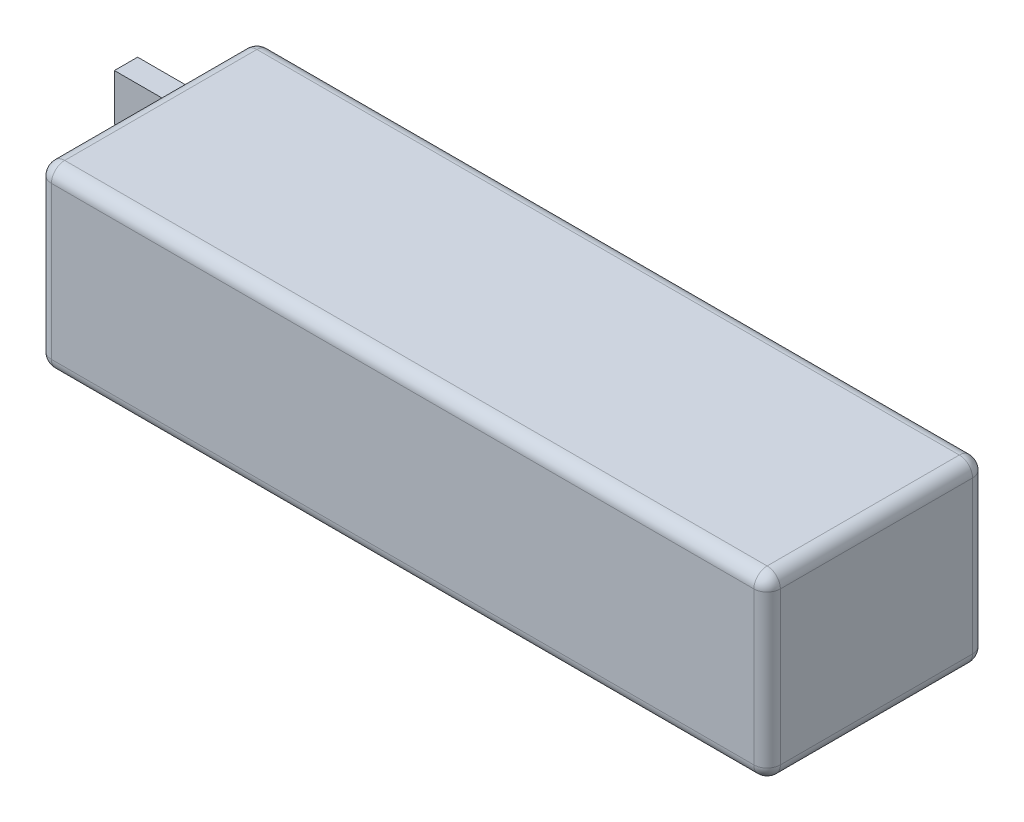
ISO-10303-21;
HEADER;
FILE_DESCRIPTION(('STEP AP214'),'2;1');
FILE_NAME('part.step','',(''),(''),'','','');
FILE_SCHEMA(('AUTOMOTIVE_DESIGN { 1 0 10303 214 1 1 1 1 }'));
ENDSEC;
DATA;
#1=APPLICATION_CONTEXT('core data for automotive mechanical design processes');
#2=APPLICATION_PROTOCOL_DEFINITION('international standard','automotive_design',2000,#1);
#3=PRODUCT_CONTEXT('',#1,'mechanical');
#4=PRODUCT('Part','Part','',(#3));
#5=PRODUCT_RELATED_PRODUCT_CATEGORY('part','',(#4));
#6=PRODUCT_DEFINITION_FORMATION('','',#4);
#7=PRODUCT_DEFINITION_CONTEXT('part definition',#1,'design');
#8=PRODUCT_DEFINITION('design','',#6,#7);
#9=PRODUCT_DEFINITION_SHAPE('','',#8);
#10=(LENGTH_UNIT() NAMED_UNIT(*) SI_UNIT(.MILLI.,.METRE.));
#11=(NAMED_UNIT(*) PLANE_ANGLE_UNIT() SI_UNIT($,.RADIAN.));
#12=(NAMED_UNIT(*) SI_UNIT($,.STERADIAN.) SOLID_ANGLE_UNIT());
#13=UNCERTAINTY_MEASURE_WITH_UNIT(LENGTH_MEASURE(1.E-05),#10,'distance_accuracy_value','');
#14=(GEOMETRIC_REPRESENTATION_CONTEXT(3) GLOBAL_UNCERTAINTY_ASSIGNED_CONTEXT((#13)) GLOBAL_UNIT_ASSIGNED_CONTEXT((#10,
#11,#12)) REPRESENTATION_CONTEXT('',''));
#15=CARTESIAN_POINT('',(0.,0.,0.));
#16=DIRECTION('',(0.,0.,1.));
#17=DIRECTION('',(1.,0.,0.));
#18=AXIS2_PLACEMENT_3D('',#15,#16,#17);
#19=CARTESIAN_POINT('',(0.,27.,0.));
#20=DIRECTION('',(1.,0.,0.));
#21=DIRECTION('',(0.,0.,-1.));
#22=AXIS2_PLACEMENT_3D('',#19,#20,#21);
#23=PLANE('',#22);
#24=DIRECTION('',(0.,0.,-1.));
#25=VECTOR('',#24,1.);
#26=CARTESIAN_POINT('',(0.,17.,-31.));
#27=LINE('',#26,#25);
#28=CARTESIAN_POINT('',(0.,17.,-27.5));
#29=VERTEX_POINT('',#28);
#30=CARTESIAN_POINT('',(0.,17.,-31.));
#31=VERTEX_POINT('',#30);
#32=EDGE_CURVE('E59',#29,#31,#27,.T.);
#33=ORIENTED_EDGE('',*,*,#32,.F.);
#34=DIRECTION('',(0.,1.,0.));
#35=VECTOR('',#34,1.);
#36=CARTESIAN_POINT('',(0.,17.,-27.5));
#37=LINE('',#36,#35);
#38=CARTESIAN_POINT('',(0.,10.,-27.5));
#39=VERTEX_POINT('',#38);
#40=EDGE_CURVE('E63',#39,#29,#37,.T.);
#41=ORIENTED_EDGE('',*,*,#40,.F.);
#42=DIRECTION('',(0.,0.,1.));
#43=VECTOR('',#42,1.);
#44=CARTESIAN_POINT('',(0.,10.,-27.5));
#45=LINE('',#44,#43);
#46=CARTESIAN_POINT('',(0.,10.,-31.));
#47=VERTEX_POINT('',#46);
#48=EDGE_CURVE('E476',#47,#39,#45,.T.);
#49=ORIENTED_EDGE('',*,*,#48,.F.);
#50=DIRECTION('',(0.,-1.,0.));
#51=VECTOR('',#50,1.);
#52=CARTESIAN_POINT('',(0.,27.,-31.));
#53=LINE('',#52,#51);
#54=CARTESIAN_POINT('',(0.,2.,-31.));
#55=VERTEX_POINT('',#54);
#56=EDGE_CURVE('E199',#47,#55,#53,.T.);
#57=ORIENTED_EDGE('',*,*,#56,.T.);
#58=DIRECTION('',(0.,0.,1.));
#59=VECTOR('',#58,1.);
#60=CARTESIAN_POINT('',(0.,2.,0.));
#61=LINE('',#60,#59);
#62=CARTESIAN_POINT('',(0.,2.,-2.));
#63=VERTEX_POINT('',#62);
#64=EDGE_CURVE('E193',#55,#63,#61,.T.);
#65=ORIENTED_EDGE('',*,*,#64,.T.);
#66=DIRECTION('',(0.,-1.,0.));
#67=VECTOR('',#66,1.);
#68=CARTESIAN_POINT('',(0.,27.,-2.));
#69=LINE('',#68,#67);
#70=CARTESIAN_POINT('',(0.,25.,-2.));
#71=VERTEX_POINT('',#70);
#72=EDGE_CURVE('E196',#63,#71,#69,.F.);
#73=ORIENTED_EDGE('',*,*,#72,.T.);
#74=DIRECTION('',(0.,0.,1.));
#75=VECTOR('',#74,1.);
#76=CARTESIAN_POINT('',(0.,25.,0.));
#77=LINE('',#76,#75);
#78=CARTESIAN_POINT('',(0.,25.,-31.));
#79=VERTEX_POINT('',#78);
#80=EDGE_CURVE('E203',#71,#79,#77,.F.);
#81=ORIENTED_EDGE('',*,*,#80,.T.);
#82=EDGE_CURVE('E200',#79,#31,#53,.T.);
#83=ORIENTED_EDGE('',*,*,#82,.T.);
#84=EDGE_LOOP('',(#33,#41,#49,#57,#65,#73,#81,#83));
#85=FACE_BOUND('',#84,.T.);
#86=ADVANCED_FACE('F41',(#85),#23,.F.);
#87=CARTESIAN_POINT('',(0.,27.,0.));
#88=DIRECTION('',(0.,0.,-1.));
#89=DIRECTION('',(-1.,0.,0.));
#90=AXIS2_PLACEMENT_3D('',#87,#88,#89);
#91=PLANE('',#90);
#92=DIRECTION('',(0.,-1.,0.));
#93=VECTOR('',#92,1.);
#94=CARTESIAN_POINT('',(108.,27.,0.));
#95=LINE('',#94,#93);
#96=CARTESIAN_POINT('',(108.,2.,0.));
#97=VERTEX_POINT('',#96);
#98=CARTESIAN_POINT('',(108.,25.,0.));
#99=VERTEX_POINT('',#98);
#100=EDGE_CURVE('E235',#97,#99,#95,.F.);
#101=ORIENTED_EDGE('',*,*,#100,.T.);
#102=DIRECTION('',(1.,0.,0.));
#103=VECTOR('',#102,1.);
#104=CARTESIAN_POINT('',(0.,25.,0.));
#105=LINE('',#104,#103);
#106=CARTESIAN_POINT('',(2.,25.,0.));
#107=VERTEX_POINT('',#106);
#108=EDGE_CURVE('E242',#99,#107,#105,.F.);
#109=ORIENTED_EDGE('',*,*,#108,.T.);
#110=DIRECTION('',(0.,-1.,0.));
#111=VECTOR('',#110,1.);
#112=CARTESIAN_POINT('',(2.,27.,0.));
#113=LINE('',#112,#111);
#114=CARTESIAN_POINT('',(2.,2.,0.));
#115=VERTEX_POINT('',#114);
#116=EDGE_CURVE('E238',#107,#115,#113,.T.);
#117=ORIENTED_EDGE('',*,*,#116,.T.);
#118=DIRECTION('',(1.,0.,0.));
#119=VECTOR('',#118,1.);
#120=CARTESIAN_POINT('',(110.,2.,0.));
#121=LINE('',#120,#119);
#122=EDGE_CURVE('E232',#115,#97,#121,.T.);
#123=ORIENTED_EDGE('',*,*,#122,.T.);
#124=EDGE_LOOP('',(#101,#109,#117,#123));
#125=FACE_BOUND('',#124,.T.);
#126=ADVANCED_FACE('F378',(#125),#91,.F.);
#127=CARTESIAN_POINT('',(110.,27.,0.));
#128=DIRECTION('',(-1.,0.,0.));
#129=DIRECTION('',(0.,0.,1.));
#130=AXIS2_PLACEMENT_3D('',#127,#128,#129);
#131=PLANE('',#130);
#132=DIRECTION('',(0.,-1.,0.));
#133=VECTOR('',#132,1.);
#134=CARTESIAN_POINT('',(110.,27.,-31.));
#135=LINE('',#134,#133);
#136=CARTESIAN_POINT('',(110.,2.,-31.));
#137=VERTEX_POINT('',#136);
#138=CARTESIAN_POINT('',(110.,25.,-31.));
#139=VERTEX_POINT('',#138);
#140=EDGE_CURVE('E225',#137,#139,#135,.F.);
#141=ORIENTED_EDGE('',*,*,#140,.T.);
#142=DIRECTION('',(0.,0.,-1.));
#143=VECTOR('',#142,1.);
#144=CARTESIAN_POINT('',(110.,25.,0.));
#145=LINE('',#144,#143);
#146=CARTESIAN_POINT('',(110.,25.,-2.));
#147=VERTEX_POINT('',#146);
#148=EDGE_CURVE('E229',#139,#147,#145,.F.);
#149=ORIENTED_EDGE('',*,*,#148,.T.);
#150=DIRECTION('',(0.,-1.,0.));
#151=VECTOR('',#150,1.);
#152=CARTESIAN_POINT('',(110.,27.,-2.));
#153=LINE('',#152,#151);
#154=CARTESIAN_POINT('',(110.,2.,-2.));
#155=VERTEX_POINT('',#154);
#156=EDGE_CURVE('E222',#147,#155,#153,.T.);
#157=ORIENTED_EDGE('',*,*,#156,.T.);
#158=DIRECTION('',(0.,0.,-1.));
#159=VECTOR('',#158,1.);
#160=CARTESIAN_POINT('',(110.,2.,-33.));
#161=LINE('',#160,#159);
#162=EDGE_CURVE('E219',#155,#137,#161,.T.);
#163=ORIENTED_EDGE('',*,*,#162,.T.);
#164=EDGE_LOOP('',(#141,#149,#157,#163));
#165=FACE_BOUND('',#164,.T.);
#166=ADVANCED_FACE('F400',(#165),#131,.F.);
#167=CARTESIAN_POINT('',(0.,27.,-33.));
#168=DIRECTION('',(0.,0.,1.));
#169=DIRECTION('',(1.,0.,0.));
#170=AXIS2_PLACEMENT_3D('',#167,#168,#169);
#171=PLANE('',#170);
#172=DIRECTION('',(0.,-1.,0.));
#173=VECTOR('',#172,1.);
#174=CARTESIAN_POINT('',(2.,27.,-33.));
#175=LINE('',#174,#173);
#176=CARTESIAN_POINT('',(2.,2.,-33.));
#177=VERTEX_POINT('',#176);
#178=CARTESIAN_POINT('',(2.,25.,-33.));
#179=VERTEX_POINT('',#178);
#180=EDGE_CURVE('E212',#177,#179,#175,.F.);
#181=ORIENTED_EDGE('',*,*,#180,.T.);
#182=DIRECTION('',(-1.,0.,0.));
#183=VECTOR('',#182,1.);
#184=CARTESIAN_POINT('',(0.,25.,-33.));
#185=LINE('',#184,#183);
#186=CARTESIAN_POINT('',(108.,25.,-33.));
#187=VERTEX_POINT('',#186);
#188=EDGE_CURVE('E216',#179,#187,#185,.F.);
#189=ORIENTED_EDGE('',*,*,#188,.T.);
#190=DIRECTION('',(0.,-1.,0.));
#191=VECTOR('',#190,1.);
#192=CARTESIAN_POINT('',(108.,27.,-33.));
#193=LINE('',#192,#191);
#194=CARTESIAN_POINT('',(108.,2.,-33.));
#195=VERTEX_POINT('',#194);
#196=EDGE_CURVE('E209',#187,#195,#193,.T.);
#197=ORIENTED_EDGE('',*,*,#196,.T.);
#198=DIRECTION('',(-1.,0.,0.));
#199=VECTOR('',#198,1.);
#200=CARTESIAN_POINT('',(0.,2.,-33.));
#201=LINE('',#200,#199);
#202=EDGE_CURVE('E206',#195,#177,#201,.T.);
#203=ORIENTED_EDGE('',*,*,#202,.T.);
#204=EDGE_LOOP('',(#181,#189,#197,#203));
#205=FACE_BOUND('',#204,.T.);
#206=ADVANCED_FACE('F471',(#205),#171,.F.);
#207=CARTESIAN_POINT('',(0.,27.,0.));
#208=DIRECTION('',(0.,-1.,0.));
#209=DIRECTION('',(0.,0.,-1.));
#210=AXIS2_PLACEMENT_3D('',#207,#208,#209);
#211=PLANE('',#210);
#212=DIRECTION('',(0.,0.,-1.));
#213=VECTOR('',#212,1.);
#214=CARTESIAN_POINT('',(108.,27.,0.));
#215=LINE('',#214,#213);
#216=CARTESIAN_POINT('',(108.,27.,-2.));
#217=VERTEX_POINT('',#216);
#218=CARTESIAN_POINT('',(108.,27.,-31.));
#219=VERTEX_POINT('',#218);
#220=EDGE_CURVE('E251',#217,#219,#215,.T.);
#221=ORIENTED_EDGE('',*,*,#220,.T.);
#222=DIRECTION('',(-1.,0.,0.));
#223=VECTOR('',#222,1.);
#224=CARTESIAN_POINT('',(0.,27.,-31.));
#225=LINE('',#224,#223);
#226=CARTESIAN_POINT('',(2.,27.,-31.));
#227=VERTEX_POINT('',#226);
#228=EDGE_CURVE('E254',#219,#227,#225,.T.);
#229=ORIENTED_EDGE('',*,*,#228,.T.);
#230=DIRECTION('',(0.,0.,1.));
#231=VECTOR('',#230,1.);
#232=CARTESIAN_POINT('',(2.,27.,0.));
#233=LINE('',#232,#231);
#234=CARTESIAN_POINT('',(2.,27.,-2.));
#235=VERTEX_POINT('',#234);
#236=EDGE_CURVE('E245',#227,#235,#233,.T.);
#237=ORIENTED_EDGE('',*,*,#236,.T.);
#238=DIRECTION('',(1.,0.,0.));
#239=VECTOR('',#238,1.);
#240=CARTESIAN_POINT('',(0.,27.,-2.));
#241=LINE('',#240,#239);
#242=EDGE_CURVE('E248',#235,#217,#241,.T.);
#243=ORIENTED_EDGE('',*,*,#242,.T.);
#244=EDGE_LOOP('',(#221,#229,#237,#243));
#245=FACE_BOUND('',#244,.T.);
#246=ADVANCED_FACE('F369',(#245),#211,.F.);
#247=CARTESIAN_POINT('',(0.,0.,0.));
#248=DIRECTION('',(0.,-1.,0.));
#249=DIRECTION('',(0.,0.,-1.));
#250=AXIS2_PLACEMENT_3D('',#247,#248,#249);
#251=PLANE('',#250);
#252=DIRECTION('',(0.,0.,-1.));
#253=VECTOR('',#252,1.);
#254=CARTESIAN_POINT('',(108.,0.,0.));
#255=LINE('',#254,#253);
#256=CARTESIAN_POINT('',(108.,0.,-31.));
#257=VERTEX_POINT('',#256);
#258=CARTESIAN_POINT('',(108.,0.,-2.));
#259=VERTEX_POINT('',#258);
#260=EDGE_CURVE('E51',#257,#259,#255,.F.);
#261=ORIENTED_EDGE('',*,*,#260,.T.);
#262=DIRECTION('',(1.,0.,0.));
#263=VECTOR('',#262,1.);
#264=CARTESIAN_POINT('',(0.,0.,-2.));
#265=LINE('',#264,#263);
#266=CARTESIAN_POINT('',(2.,0.,-2.));
#267=VERTEX_POINT('',#266);
#268=EDGE_CURVE('E11',#259,#267,#265,.F.);
#269=ORIENTED_EDGE('',*,*,#268,.T.);
#270=DIRECTION('',(0.,0.,1.));
#271=VECTOR('',#270,1.);
#272=CARTESIAN_POINT('',(2.,0.,-33.));
#273=LINE('',#272,#271);
#274=CARTESIAN_POINT('',(2.,0.,-31.));
#275=VERTEX_POINT('',#274);
#276=EDGE_CURVE('E258',#267,#275,#273,.F.);
#277=ORIENTED_EDGE('',*,*,#276,.T.);
#278=DIRECTION('',(-1.,0.,0.));
#279=VECTOR('',#278,1.);
#280=CARTESIAN_POINT('',(110.,0.,-31.));
#281=LINE('',#280,#279);
#282=EDGE_CURVE('E261',#275,#257,#281,.F.);
#283=ORIENTED_EDGE('',*,*,#282,.T.);
#284=EDGE_LOOP('',(#261,#269,#277,#283));
#285=FACE_BOUND('',#284,.T.);
#286=ADVANCED_FACE('F515',(#285),#251,.T.);
#287=CARTESIAN_POINT('',(108.,27.,-2.));
#288=DIRECTION('',(0.,-1.,0.));
#289=DIRECTION('',(0.,0.,-1.));
#290=AXIS2_PLACEMENT_3D('',#287,#288,#289);
#291=CYLINDRICAL_SURFACE('',#290,2.);
#292=CARTESIAN_POINT('',(108.,25.,-2.));
#293=DIRECTION('',(0.,1.,0.));
#294=DIRECTION('',(0.,0.,1.));
#295=AXIS2_PLACEMENT_3D('',#292,#293,#294);
#296=CIRCLE('',#295,2.);
#297=EDGE_CURVE('E45',#99,#147,#296,.T.);
#298=ORIENTED_EDGE('',*,*,#297,.F.);
#299=ORIENTED_EDGE('',*,*,#100,.F.);
#300=CARTESIAN_POINT('',(108.,2.,-2.));
#301=DIRECTION('',(0.,-1.,0.));
#302=DIRECTION('',(0.,0.,-1.));
#303=AXIS2_PLACEMENT_3D('',#300,#301,#302);
#304=CIRCLE('',#303,2.);
#305=EDGE_CURVE('E344',#155,#97,#304,.T.);
#306=ORIENTED_EDGE('',*,*,#305,.F.);
#307=ORIENTED_EDGE('',*,*,#156,.F.);
#308=EDGE_LOOP('',(#298,#299,#306,#307));
#309=FACE_BOUND('',#308,.T.);
#310=ADVANCED_FACE('F43',(#309),#291,.T.);
#311=CARTESIAN_POINT('',(108.,25.,-2.));
#312=DIRECTION('',(0.,0.,1.));
#313=DIRECTION('',(1.,0.,0.));
#314=AXIS2_PLACEMENT_3D('',#311,#312,#313);
#315=SPHERICAL_SURFACE('',#314,2.);
#316=CARTESIAN_POINT('',(108.,25.,-2.));
#317=DIRECTION('',(1.,0.,0.));
#318=DIRECTION('',(0.,0.,-1.));
#319=AXIS2_PLACEMENT_3D('',#316,#317,#318);
#320=CIRCLE('',#319,2.);
#321=EDGE_CURVE('E337',#99,#217,#320,.F.);
#322=ORIENTED_EDGE('',*,*,#321,.F.);
#323=ORIENTED_EDGE('',*,*,#297,.T.);
#324=CARTESIAN_POINT('',(108.,25.,-2.));
#325=DIRECTION('',(0.,0.,1.));
#326=DIRECTION('',(1.,0.,0.));
#327=AXIS2_PLACEMENT_3D('',#324,#325,#326);
#328=CIRCLE('',#327,2.);
#329=EDGE_CURVE('E341',#217,#147,#328,.F.);
#330=ORIENTED_EDGE('',*,*,#329,.F.);
#331=EDGE_LOOP('',(#322,#323,#330));
#332=FACE_BOUND('',#331,.T.);
#333=ADVANCED_FACE('F357',(#332),#315,.T.);
#334=CARTESIAN_POINT('',(108.,2.,-2.));
#335=DIRECTION('',(0.,0.,1.));
#336=DIRECTION('',(1.,0.,0.));
#337=AXIS2_PLACEMENT_3D('',#334,#335,#336);
#338=SPHERICAL_SURFACE('',#337,2.);
#339=CARTESIAN_POINT('',(108.,2.,-2.));
#340=DIRECTION('',(0.,0.,1.));
#341=DIRECTION('',(1.,0.,0.));
#342=AXIS2_PLACEMENT_3D('',#339,#340,#341);
#343=CIRCLE('',#342,2.);
#344=EDGE_CURVE('E329',#155,#259,#343,.F.);
#345=ORIENTED_EDGE('',*,*,#344,.F.);
#346=ORIENTED_EDGE('',*,*,#305,.T.);
#347=CARTESIAN_POINT('',(108.,2.,-2.));
#348=DIRECTION('',(1.,0.,0.));
#349=DIRECTION('',(0.,0.,-1.));
#350=AXIS2_PLACEMENT_3D('',#347,#348,#349);
#351=CIRCLE('',#350,2.);
#352=EDGE_CURVE('E333',#259,#97,#351,.F.);
#353=ORIENTED_EDGE('',*,*,#352,.F.);
#354=EDGE_LOOP('',(#345,#346,#353));
#355=FACE_BOUND('',#354,.T.);
#356=ADVANCED_FACE('F393',(#355),#338,.T.);
#357=CARTESIAN_POINT('',(108.,25.,0.));
#358=DIRECTION('',(0.,0.,-1.));
#359=DIRECTION('',(-1.,0.,0.));
#360=AXIS2_PLACEMENT_3D('',#357,#358,#359);
#361=CYLINDRICAL_SURFACE('',#360,2.);
#362=ORIENTED_EDGE('',*,*,#329,.T.);
#363=ORIENTED_EDGE('',*,*,#148,.F.);
#364=CARTESIAN_POINT('',(108.,25.,-31.));
#365=DIRECTION('',(0.,0.,-1.));
#366=DIRECTION('',(-1.,0.,0.));
#367=AXIS2_PLACEMENT_3D('',#364,#365,#366);
#368=CIRCLE('',#367,2.);
#369=EDGE_CURVE('E322',#219,#139,#368,.T.);
#370=ORIENTED_EDGE('',*,*,#369,.F.);
#371=ORIENTED_EDGE('',*,*,#220,.F.);
#372=EDGE_LOOP('',(#362,#363,#370,#371));
#373=FACE_BOUND('',#372,.T.);
#374=ADVANCED_FACE('F365',(#373),#361,.T.);
#375=CARTESIAN_POINT('',(0.,25.,-2.));
#376=DIRECTION('',(1.,0.,0.));
#377=DIRECTION('',(0.,0.,-1.));
#378=AXIS2_PLACEMENT_3D('',#375,#376,#377);
#379=CYLINDRICAL_SURFACE('',#378,2.);
#380=ORIENTED_EDGE('',*,*,#321,.T.);
#381=ORIENTED_EDGE('',*,*,#242,.F.);
#382=CARTESIAN_POINT('',(2.,25.,-2.));
#383=DIRECTION('',(-1.,0.,0.));
#384=DIRECTION('',(0.,0.,1.));
#385=AXIS2_PLACEMENT_3D('',#382,#383,#384);
#386=CIRCLE('',#385,2.);
#387=EDGE_CURVE('E318',#107,#235,#386,.T.);
#388=ORIENTED_EDGE('',*,*,#387,.F.);
#389=ORIENTED_EDGE('',*,*,#108,.F.);
#390=EDGE_LOOP('',(#380,#381,#388,#389));
#391=FACE_BOUND('',#390,.T.);
#392=ADVANCED_FACE('F375',(#391),#379,.T.);
#393=CARTESIAN_POINT('',(2.,27.,-2.));
#394=DIRECTION('',(0.,-1.,0.));
#395=DIRECTION('',(0.,0.,-1.));
#396=AXIS2_PLACEMENT_3D('',#393,#394,#395);
#397=CYLINDRICAL_SURFACE('',#396,2.);
#398=CARTESIAN_POINT('',(2.,2.,-2.));
#399=DIRECTION('',(0.,-1.,0.));
#400=DIRECTION('',(0.,0.,-1.));
#401=AXIS2_PLACEMENT_3D('',#398,#399,#400);
#402=CIRCLE('',#401,2.);
#403=EDGE_CURVE('E310',#115,#63,#402,.T.);
#404=ORIENTED_EDGE('',*,*,#403,.F.);
#405=ORIENTED_EDGE('',*,*,#116,.F.);
#406=CARTESIAN_POINT('',(2.,25.,-2.));
#407=DIRECTION('',(0.,1.,0.));
#408=DIRECTION('',(0.,0.,1.));
#409=AXIS2_PLACEMENT_3D('',#406,#407,#408);
#410=CIRCLE('',#409,2.);
#411=EDGE_CURVE('E314',#71,#107,#410,.T.);
#412=ORIENTED_EDGE('',*,*,#411,.F.);
#413=ORIENTED_EDGE('',*,*,#72,.F.);
#414=EDGE_LOOP('',(#404,#405,#412,#413));
#415=FACE_BOUND('',#414,.T.);
#416=ADVANCED_FACE('F382',(#415),#397,.T.);
#417=CARTESIAN_POINT('',(0.,2.,-2.));
#418=DIRECTION('',(-1.,0.,0.));
#419=DIRECTION('',(0.,0.,1.));
#420=AXIS2_PLACEMENT_3D('',#417,#418,#419);
#421=CYLINDRICAL_SURFACE('',#420,2.);
#422=ORIENTED_EDGE('',*,*,#352,.T.);
#423=ORIENTED_EDGE('',*,*,#122,.F.);
#424=CARTESIAN_POINT('',(2.,2.,-2.));
#425=DIRECTION('',(-1.,0.,0.));
#426=DIRECTION('',(0.,0.,1.));
#427=AXIS2_PLACEMENT_3D('',#424,#425,#426);
#428=CIRCLE('',#427,2.);
#429=EDGE_CURVE('E307',#267,#115,#428,.T.);
#430=ORIENTED_EDGE('',*,*,#429,.F.);
#431=ORIENTED_EDGE('',*,*,#268,.F.);
#432=EDGE_LOOP('',(#422,#423,#430,#431));
#433=FACE_BOUND('',#432,.T.);
#434=ADVANCED_FACE('F390',(#433),#421,.T.);
#435=CARTESIAN_POINT('',(108.,2.,0.));
#436=DIRECTION('',(0.,0.,1.));
#437=DIRECTION('',(1.,0.,0.));
#438=AXIS2_PLACEMENT_3D('',#435,#436,#437);
#439=CYLINDRICAL_SURFACE('',#438,2.);
#440=ORIENTED_EDGE('',*,*,#344,.T.);
#441=ORIENTED_EDGE('',*,*,#260,.F.);
#442=CARTESIAN_POINT('',(108.,2.,-31.));
#443=DIRECTION('',(0.,0.,-1.));
#444=DIRECTION('',(-1.,0.,0.));
#445=AXIS2_PLACEMENT_3D('',#442,#443,#444);
#446=CIRCLE('',#445,2.);
#447=EDGE_CURVE('E303',#137,#257,#446,.T.);
#448=ORIENTED_EDGE('',*,*,#447,.F.);
#449=ORIENTED_EDGE('',*,*,#162,.F.);
#450=EDGE_LOOP('',(#440,#441,#448,#449));
#451=FACE_BOUND('',#450,.T.);
#452=ADVANCED_FACE('F397',(#451),#439,.T.);
#453=CARTESIAN_POINT('',(108.,27.,-31.));
#454=DIRECTION('',(0.,-1.,0.));
#455=DIRECTION('',(0.,0.,-1.));
#456=AXIS2_PLACEMENT_3D('',#453,#454,#455);
#457=CYLINDRICAL_SURFACE('',#456,2.);
#458=CARTESIAN_POINT('',(108.,25.,-31.));
#459=DIRECTION('',(0.,1.,0.));
#460=DIRECTION('',(0.,0.,1.));
#461=AXIS2_PLACEMENT_3D('',#458,#459,#460);
#462=CIRCLE('',#461,2.);
#463=EDGE_CURVE('E325',#139,#187,#462,.T.);
#464=ORIENTED_EDGE('',*,*,#463,.F.);
#465=ORIENTED_EDGE('',*,*,#140,.F.);
#466=CARTESIAN_POINT('',(108.,2.,-31.));
#467=DIRECTION('',(0.,-1.,0.));
#468=DIRECTION('',(0.,0.,-1.));
#469=AXIS2_PLACEMENT_3D('',#466,#467,#468);
#470=CIRCLE('',#469,2.);
#471=EDGE_CURVE('E299',#195,#137,#470,.T.);
#472=ORIENTED_EDGE('',*,*,#471,.F.);
#473=ORIENTED_EDGE('',*,*,#196,.F.);
#474=EDGE_LOOP('',(#464,#465,#472,#473));
#475=FACE_BOUND('',#474,.T.);
#476=ADVANCED_FACE('F404',(#475),#457,.T.);
#477=CARTESIAN_POINT('',(108.,25.,-31.));
#478=DIRECTION('',(0.,0.,1.));
#479=DIRECTION('',(1.,0.,0.));
#480=AXIS2_PLACEMENT_3D('',#477,#478,#479);
#481=SPHERICAL_SURFACE('',#480,2.);
#482=ORIENTED_EDGE('',*,*,#369,.T.);
#483=ORIENTED_EDGE('',*,*,#463,.T.);
#484=CARTESIAN_POINT('',(108.,25.,-31.));
#485=DIRECTION('',(1.,0.,0.));
#486=DIRECTION('',(0.,0.,-1.));
#487=AXIS2_PLACEMENT_3D('',#484,#485,#486);
#488=CIRCLE('',#487,2.);
#489=EDGE_CURVE('E295',#219,#187,#488,.F.);
#490=ORIENTED_EDGE('',*,*,#489,.F.);
#491=EDGE_LOOP('',(#482,#483,#490));
#492=FACE_BOUND('',#491,.T.);
#493=ADVANCED_FACE('F408',(#492),#481,.T.);
#494=CARTESIAN_POINT('',(2.,25.,-2.));
#495=DIRECTION('',(0.,0.,1.));
#496=DIRECTION('',(1.,0.,0.));
#497=AXIS2_PLACEMENT_3D('',#494,#495,#496);
#498=SPHERICAL_SURFACE('',#497,2.);
#499=ORIENTED_EDGE('',*,*,#411,.T.);
#500=ORIENTED_EDGE('',*,*,#387,.T.);
#501=CARTESIAN_POINT('',(2.,25.,-2.));
#502=DIRECTION('',(0.,0.,1.));
#503=DIRECTION('',(1.,0.,0.));
#504=AXIS2_PLACEMENT_3D('',#501,#502,#503);
#505=CIRCLE('',#504,2.);
#506=EDGE_CURVE('E291',#71,#235,#505,.F.);
#507=ORIENTED_EDGE('',*,*,#506,.F.);
#508=EDGE_LOOP('',(#499,#500,#507));
#509=FACE_BOUND('',#508,.T.);
#510=ADVANCED_FACE('F420',(#509),#498,.T.);
#511=CARTESIAN_POINT('',(2.,2.,-2.));
#512=DIRECTION('',(0.,0.,1.));
#513=DIRECTION('',(1.,0.,0.));
#514=AXIS2_PLACEMENT_3D('',#511,#512,#513);
#515=SPHERICAL_SURFACE('',#514,2.);
#516=ORIENTED_EDGE('',*,*,#429,.T.);
#517=ORIENTED_EDGE('',*,*,#403,.T.);
#518=CARTESIAN_POINT('',(2.,2.,-2.));
#519=DIRECTION('',(0.,0.,1.));
#520=DIRECTION('',(1.,0.,0.));
#521=AXIS2_PLACEMENT_3D('',#518,#519,#520);
#522=CIRCLE('',#521,2.);
#523=EDGE_CURVE('E287',#267,#63,#522,.F.);
#524=ORIENTED_EDGE('',*,*,#523,.F.);
#525=EDGE_LOOP('',(#516,#517,#524));
#526=FACE_BOUND('',#525,.T.);
#527=ADVANCED_FACE('F422',(#526),#515,.T.);
#528=CARTESIAN_POINT('',(108.,2.,-31.));
#529=DIRECTION('',(0.,0.,1.));
#530=DIRECTION('',(1.,0.,0.));
#531=AXIS2_PLACEMENT_3D('',#528,#529,#530);
#532=SPHERICAL_SURFACE('',#531,2.);
#533=ORIENTED_EDGE('',*,*,#471,.T.);
#534=ORIENTED_EDGE('',*,*,#447,.T.);
#535=CARTESIAN_POINT('',(108.,2.,-31.));
#536=DIRECTION('',(1.,0.,0.));
#537=DIRECTION('',(0.,0.,-1.));
#538=AXIS2_PLACEMENT_3D('',#535,#536,#537);
#539=CIRCLE('',#538,2.);
#540=EDGE_CURVE('E283',#195,#257,#539,.F.);
#541=ORIENTED_EDGE('',*,*,#540,.F.);
#542=EDGE_LOOP('',(#533,#534,#541));
#543=FACE_BOUND('',#542,.T.);
#544=ADVANCED_FACE('F428',(#543),#532,.T.);
#545=CARTESIAN_POINT('',(0.,25.,-31.));
#546=DIRECTION('',(-1.,0.,0.));
#547=DIRECTION('',(0.,0.,1.));
#548=AXIS2_PLACEMENT_3D('',#545,#546,#547);
#549=CYLINDRICAL_SURFACE('',#548,2.);
#550=ORIENTED_EDGE('',*,*,#489,.T.);
#551=ORIENTED_EDGE('',*,*,#188,.F.);
#552=CARTESIAN_POINT('',(2.,25.,-31.));
#553=DIRECTION('',(-1.,0.,0.));
#554=DIRECTION('',(0.,0.,1.));
#555=AXIS2_PLACEMENT_3D('',#552,#553,#554);
#556=CIRCLE('',#555,2.);
#557=EDGE_CURVE('E279',#227,#179,#556,.T.);
#558=ORIENTED_EDGE('',*,*,#557,.F.);
#559=ORIENTED_EDGE('',*,*,#228,.F.);
#560=EDGE_LOOP('',(#550,#551,#558,#559));
#561=FACE_BOUND('',#560,.T.);
#562=ADVANCED_FACE('F411',(#561),#549,.T.);
#563=CARTESIAN_POINT('',(2.,25.,0.));
#564=DIRECTION('',(0.,0.,1.));
#565=DIRECTION('',(1.,0.,0.));
#566=AXIS2_PLACEMENT_3D('',#563,#564,#565);
#567=CYLINDRICAL_SURFACE('',#566,2.);
#568=ORIENTED_EDGE('',*,*,#506,.T.);
#569=ORIENTED_EDGE('',*,*,#236,.F.);
#570=CARTESIAN_POINT('',(2.,25.,-31.));
#571=DIRECTION('',(0.,0.,-1.));
#572=DIRECTION('',(-1.,0.,0.));
#573=AXIS2_PLACEMENT_3D('',#570,#571,#572);
#574=CIRCLE('',#573,2.);
#575=EDGE_CURVE('E276',#79,#227,#574,.T.);
#576=ORIENTED_EDGE('',*,*,#575,.F.);
#577=ORIENTED_EDGE('',*,*,#80,.F.);
#578=EDGE_LOOP('',(#568,#569,#576,#577));
#579=FACE_BOUND('',#578,.T.);
#580=ADVANCED_FACE('F417',(#579),#567,.T.);
#581=CARTESIAN_POINT('',(2.,2.,0.));
#582=DIRECTION('',(0.,0.,-1.));
#583=DIRECTION('',(-1.,0.,0.));
#584=AXIS2_PLACEMENT_3D('',#581,#582,#583);
#585=CYLINDRICAL_SURFACE('',#584,2.);
#586=ORIENTED_EDGE('',*,*,#523,.T.);
#587=ORIENTED_EDGE('',*,*,#64,.F.);
#588=CARTESIAN_POINT('',(2.,2.,-31.));
#589=DIRECTION('',(0.,0.,-1.));
#590=DIRECTION('',(-1.,0.,0.));
#591=AXIS2_PLACEMENT_3D('',#588,#589,#590);
#592=CIRCLE('',#591,2.);
#593=EDGE_CURVE('E272',#275,#55,#592,.T.);
#594=ORIENTED_EDGE('',*,*,#593,.F.);
#595=ORIENTED_EDGE('',*,*,#276,.F.);
#596=EDGE_LOOP('',(#586,#587,#594,#595));
#597=FACE_BOUND('',#596,.T.);
#598=ADVANCED_FACE('F453',(#597),#585,.T.);
#599=CARTESIAN_POINT('',(0.,2.,-31.));
#600=DIRECTION('',(1.,0.,0.));
#601=DIRECTION('',(0.,0.,-1.));
#602=AXIS2_PLACEMENT_3D('',#599,#600,#601);
#603=CYLINDRICAL_SURFACE('',#602,2.);
#604=ORIENTED_EDGE('',*,*,#540,.T.);
#605=ORIENTED_EDGE('',*,*,#282,.F.);
#606=CARTESIAN_POINT('',(2.,2.,-31.));
#607=DIRECTION('',(-1.,0.,0.));
#608=DIRECTION('',(0.,0.,1.));
#609=AXIS2_PLACEMENT_3D('',#606,#607,#608);
#610=CIRCLE('',#609,2.);
#611=EDGE_CURVE('E268',#177,#275,#610,.T.);
#612=ORIENTED_EDGE('',*,*,#611,.F.);
#613=ORIENTED_EDGE('',*,*,#202,.F.);
#614=EDGE_LOOP('',(#604,#605,#612,#613));
#615=FACE_BOUND('',#614,.T.);
#616=ADVANCED_FACE('F450',(#615),#603,.T.);
#617=CARTESIAN_POINT('',(2.,25.,-31.));
#618=DIRECTION('',(0.,0.,1.));
#619=DIRECTION('',(1.,0.,0.));
#620=AXIS2_PLACEMENT_3D('',#617,#618,#619);
#621=SPHERICAL_SURFACE('',#620,2.);
#622=ORIENTED_EDGE('',*,*,#575,.T.);
#623=ORIENTED_EDGE('',*,*,#557,.T.);
#624=CARTESIAN_POINT('',(2.,25.,-31.));
#625=DIRECTION('',(0.,1.,0.));
#626=DIRECTION('',(0.,0.,1.));
#627=AXIS2_PLACEMENT_3D('',#624,#625,#626);
#628=CIRCLE('',#627,2.);
#629=EDGE_CURVE('E187',#79,#179,#628,.F.);
#630=ORIENTED_EDGE('',*,*,#629,.F.);
#631=EDGE_LOOP('',(#622,#623,#630));
#632=FACE_BOUND('',#631,.T.);
#633=ADVANCED_FACE('F446',(#632),#621,.T.);
#634=CARTESIAN_POINT('',(2.,2.,-31.));
#635=DIRECTION('',(0.,0.,1.));
#636=DIRECTION('',(1.,0.,0.));
#637=AXIS2_PLACEMENT_3D('',#634,#635,#636);
#638=SPHERICAL_SURFACE('',#637,2.);
#639=ORIENTED_EDGE('',*,*,#611,.T.);
#640=ORIENTED_EDGE('',*,*,#593,.T.);
#641=CARTESIAN_POINT('',(2.,2.,-31.));
#642=DIRECTION('',(0.,-1.,0.));
#643=DIRECTION('',(0.,0.,-1.));
#644=AXIS2_PLACEMENT_3D('',#641,#642,#643);
#645=CIRCLE('',#644,2.);
#646=EDGE_CURVE('E182',#177,#55,#645,.F.);
#647=ORIENTED_EDGE('',*,*,#646,.F.);
#648=EDGE_LOOP('',(#639,#640,#647));
#649=FACE_BOUND('',#648,.T.);
#650=ADVANCED_FACE('F442',(#649),#638,.T.);
#651=CARTESIAN_POINT('',(2.,27.,-31.));
#652=DIRECTION('',(0.,-1.,0.));
#653=DIRECTION('',(0.,0.,-1.));
#654=AXIS2_PLACEMENT_3D('',#651,#652,#653);
#655=CYLINDRICAL_SURFACE('',#654,2.);
#656=ORIENTED_EDGE('',*,*,#629,.T.);
#657=ORIENTED_EDGE('',*,*,#180,.F.);
#658=ORIENTED_EDGE('',*,*,#646,.T.);
#659=ORIENTED_EDGE('',*,*,#56,.F.);
#660=DIRECTION('',(0.,-1.,0.));
#661=VECTOR('',#660,1.);
#662=CARTESIAN_POINT('',(0.,10.,-31.));
#663=LINE('',#662,#661);
#664=EDGE_CURVE('E478',#31,#47,#663,.T.);
#665=ORIENTED_EDGE('',*,*,#664,.F.);
#666=ORIENTED_EDGE('',*,*,#82,.F.);
#667=EDGE_LOOP('',(#656,#657,#658,#659,#665,#666));
#668=FACE_BOUND('',#667,.T.);
#669=ADVANCED_FACE('F439',(#668),#655,.T.);
#670=CARTESIAN_POINT('',(-16.,17.,-31.));
#671=DIRECTION('',(0.,-1.,0.));
#672=DIRECTION('',(0.,0.,-1.));
#673=AXIS2_PLACEMENT_3D('',#670,#671,#672);
#674=PLANE('',#673);
#675=ORIENTED_EDGE('',*,*,#32,.T.);
#676=DIRECTION('',(1.,0.,0.));
#677=VECTOR('',#676,1.);
#678=CARTESIAN_POINT('',(-16.,17.,-31.));
#679=LINE('',#678,#677);
#680=CARTESIAN_POINT('',(-16.,17.,-31.));
#681=VERTEX_POINT('',#680);
#682=EDGE_CURVE('E162',#681,#31,#679,.T.);
#683=ORIENTED_EDGE('',*,*,#682,.F.);
#684=DIRECTION('',(0.,0.,-1.));
#685=VECTOR('',#684,1.);
#686=CARTESIAN_POINT('',(-16.,17.,-31.));
#687=LINE('',#686,#685);
#688=CARTESIAN_POINT('',(-16.,17.,-27.5));
#689=VERTEX_POINT('',#688);
#690=EDGE_CURVE('E169',#689,#681,#687,.T.);
#691=ORIENTED_EDGE('',*,*,#690,.F.);
#692=DIRECTION('',(1.,0.,0.));
#693=VECTOR('',#692,1.);
#694=CARTESIAN_POINT('',(-16.,17.,-27.5));
#695=LINE('',#694,#693);
#696=EDGE_CURVE('E489',#689,#29,#695,.T.);
#697=ORIENTED_EDGE('',*,*,#696,.T.);
#698=EDGE_LOOP('',(#675,#683,#691,#697));
#699=FACE_BOUND('',#698,.T.);
#700=ADVANCED_FACE('F180',(#699),#674,.F.);
#701=CARTESIAN_POINT('',(-16.,10.,-31.));
#702=DIRECTION('',(0.,0.,1.));
#703=DIRECTION('',(0.,-1.,0.));
#704=AXIS2_PLACEMENT_3D('',#701,#702,#703);
#705=PLANE('',#704);
#706=ORIENTED_EDGE('',*,*,#664,.T.);
#707=DIRECTION('',(1.,0.,0.));
#708=VECTOR('',#707,1.);
#709=CARTESIAN_POINT('',(-16.,10.,-31.));
#710=LINE('',#709,#708);
#711=CARTESIAN_POINT('',(-16.,10.,-31.));
#712=VERTEX_POINT('',#711);
#713=EDGE_CURVE('E164',#712,#47,#710,.T.);
#714=ORIENTED_EDGE('',*,*,#713,.F.);
#715=DIRECTION('',(0.,-1.,0.));
#716=VECTOR('',#715,1.);
#717=CARTESIAN_POINT('',(-16.,10.,-31.));
#718=LINE('',#717,#716);
#719=EDGE_CURVE('E157',#681,#712,#718,.T.);
#720=ORIENTED_EDGE('',*,*,#719,.F.);
#721=ORIENTED_EDGE('',*,*,#682,.T.);
#722=EDGE_LOOP('',(#706,#714,#720,#721));
#723=FACE_BOUND('',#722,.T.);
#724=ADVANCED_FACE('F160',(#723),#705,.F.);
#725=CARTESIAN_POINT('',(-16.,10.,-27.5));
#726=DIRECTION('',(0.,1.,0.));
#727=DIRECTION('',(0.,0.,1.));
#728=AXIS2_PLACEMENT_3D('',#725,#726,#727);
#729=PLANE('',#728);
#730=ORIENTED_EDGE('',*,*,#48,.T.);
#731=DIRECTION('',(1.,0.,0.));
#732=VECTOR('',#731,1.);
#733=CARTESIAN_POINT('',(-16.,10.,-27.5));
#734=LINE('',#733,#732);
#735=CARTESIAN_POINT('',(-16.,10.,-27.5));
#736=VERTEX_POINT('',#735);
#737=EDGE_CURVE('E189',#736,#39,#734,.T.);
#738=ORIENTED_EDGE('',*,*,#737,.F.);
#739=DIRECTION('',(0.,0.,1.));
#740=VECTOR('',#739,1.);
#741=CARTESIAN_POINT('',(-16.,10.,-27.5));
#742=LINE('',#741,#740);
#743=EDGE_CURVE('E168',#712,#736,#742,.T.);
#744=ORIENTED_EDGE('',*,*,#743,.F.);
#745=ORIENTED_EDGE('',*,*,#713,.T.);
#746=EDGE_LOOP('',(#730,#738,#744,#745));
#747=FACE_BOUND('',#746,.T.);
#748=ADVANCED_FACE('F497',(#747),#729,.F.);
#749=CARTESIAN_POINT('',(-16.,17.,-27.5));
#750=DIRECTION('',(0.,0.,-1.));
#751=DIRECTION('',(0.,1.,0.));
#752=AXIS2_PLACEMENT_3D('',#749,#750,#751);
#753=PLANE('',#752);
#754=ORIENTED_EDGE('',*,*,#40,.T.);
#755=ORIENTED_EDGE('',*,*,#696,.F.);
#756=DIRECTION('',(0.,1.,0.));
#757=VECTOR('',#756,1.);
#758=CARTESIAN_POINT('',(-16.,17.,-27.5));
#759=LINE('',#758,#757);
#760=EDGE_CURVE('E174',#736,#689,#759,.T.);
#761=ORIENTED_EDGE('',*,*,#760,.F.);
#762=ORIENTED_EDGE('',*,*,#737,.T.);
#763=EDGE_LOOP('',(#754,#755,#761,#762));
#764=FACE_BOUND('',#763,.T.);
#765=ADVANCED_FACE('F495',(#764),#753,.F.);
#766=CARTESIAN_POINT('',(-16.,0.,0.));
#767=DIRECTION('',(1.,0.,0.));
#768=DIRECTION('',(0.,0.,-1.));
#769=AXIS2_PLACEMENT_3D('',#766,#767,#768);
#770=PLANE('',#769);
#771=ORIENTED_EDGE('',*,*,#690,.T.);
#772=ORIENTED_EDGE('',*,*,#719,.T.);
#773=ORIENTED_EDGE('',*,*,#743,.T.);
#774=ORIENTED_EDGE('',*,*,#760,.T.);
#775=EDGE_LOOP('',(#771,#772,#773,#774));
#776=FACE_BOUND('',#775,.T.);
#777=ADVANCED_FACE('F172',(#776),#770,.F.);
#778=CLOSED_SHELL('',(#86,#126,#166,#206,#246,#286,#310,#333,#356,#374,#392,#416,#434,#452,#476,
#493,#510,#527,#544,#562,#580,#598,#616,#633,#650,#669,#700,#724,#748,#765,#777));
#779=MANIFOLD_SOLID_BREP('B2',#778);
#780=ADVANCED_BREP_SHAPE_REPRESENTATION('',(#18,#779),#14);
#781=SHAPE_DEFINITION_REPRESENTATION(#9,#780);
ENDSEC;
END-ISO-10303-21;
